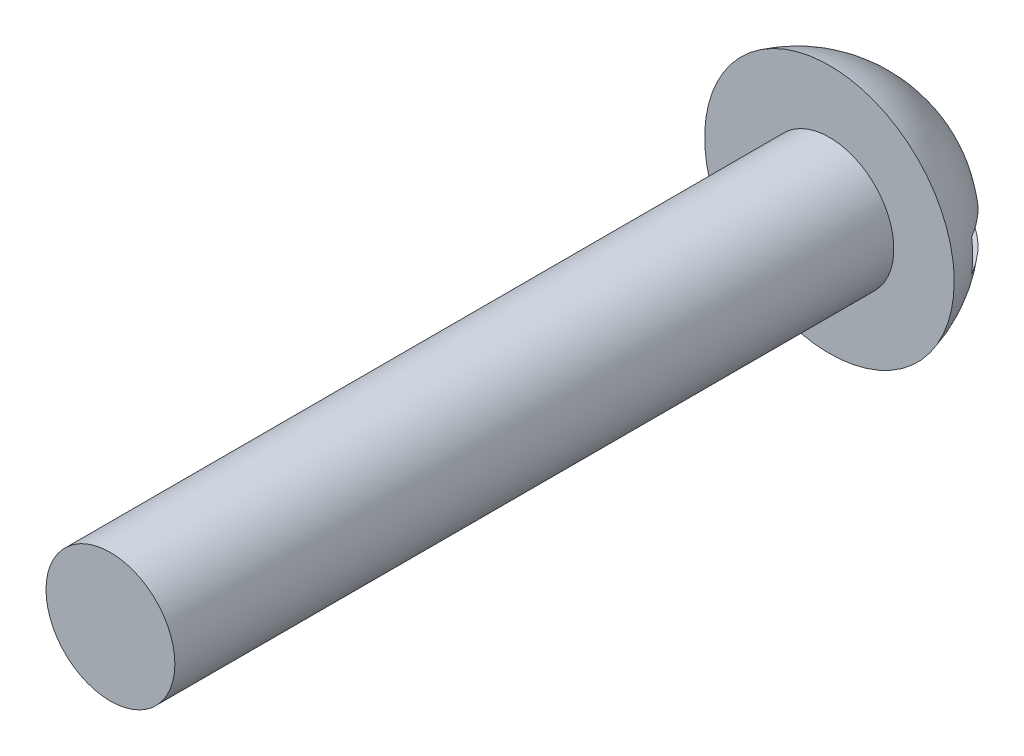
from build123d import *

# Parameters (mm, degrees)
SKETCH2_R           = 1.4224
BOSS_EXTRUDE1_DEPTH = 15.875
CUT_EXTRUDE1_DEPTH  = 43.817135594


with BuildPart() as part:
    # Sketch1 → Base-Revolve (revolve)
    with BuildSketch(Plane(origin=(0, 0, 0), x_dir=(0, 0, -1), z_dir=(1, 0, 0))):
        with BuildLine():
            Line((-22.86, 15.282157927), (-20.7264, 15.282157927))
            ThreePointArc((-20.7264, 15.282157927), (-21.322188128, 17.024235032), (-22.86, 18.036623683))
            Line((-22.86, 18.036623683), (-22.86, 15.282157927))
        make_face()
    revolve(axis=Axis((0, 15.282157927, 28.59405), (0, 0, -1)))

    # Sketch2 → Boss-Extrude1 (add)
    with BuildSketch(Plane.XY.offset(22.86)):
        with Locations(Location((0, 15.24, 0), (0, 0, 180))):
            Circle(SKETCH2_R)
    extrude(amount=BOSS_EXTRUDE1_DEPTH)

    # Sketch4 → Cut-Extrude1 (cut, through all)
    with BuildSketch(Plane(origin=(0, 0, 0), x_dir=(0, 0, -1), z_dir=(1, 0, 0))):
        with BuildLine():
            Line((-22.171112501, 14.926557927), (-20.748712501, 14.926557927))
            ThreePointArc((-20.748712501, 14.926557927), (-20.7264, 15.282157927), (-20.748712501, 15.637757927))
            Line((-20.748712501, 15.637757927), (-22.171112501, 15.637757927))
            Line((-22.171112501, 15.637757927), (-22.171112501, 14.926557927))
        make_face()
    cut_extrude1 = extrude(amount=-CUT_EXTRUDE1_DEPTH, mode=Mode.SUBTRACT)

    # Mirror1: Cut-Extrude1 across plane
    add(cut_extrude1.mirror(Plane(origin=(0, 15.282157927, 23.5712), x_dir=(0, 0, 1), z_dir=(1, 0, 0))), mode=Mode.SUBTRACT)


solid = part.part
